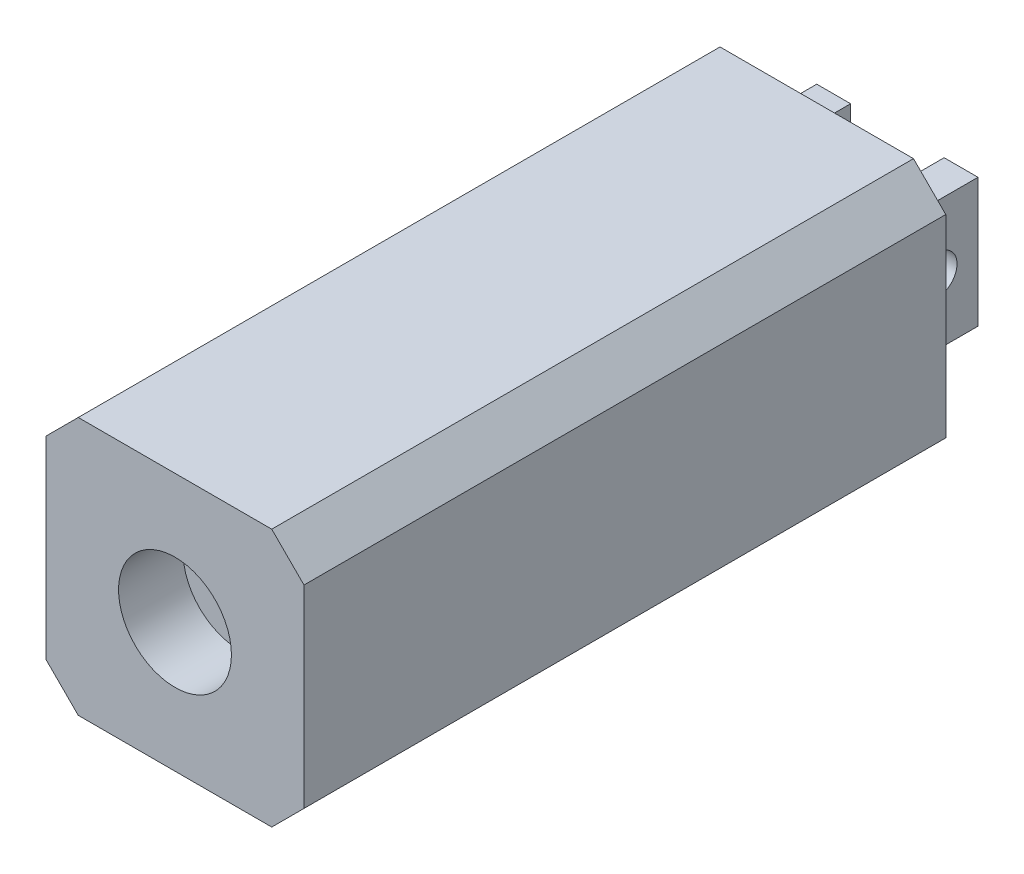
ISO-10303-21;
HEADER;
FILE_DESCRIPTION(('STEP AP214'),'2;1');
FILE_NAME('part.step','',(''),(''),'','','');
FILE_SCHEMA(('AUTOMOTIVE_DESIGN { 1 0 10303 214 1 1 1 1 }'));
ENDSEC;
DATA;
#1=APPLICATION_CONTEXT('core data for automotive mechanical design processes');
#2=APPLICATION_PROTOCOL_DEFINITION('international standard','automotive_design',2000,#1);
#3=PRODUCT_CONTEXT('',#1,'mechanical');
#4=PRODUCT('Part','Part','',(#3));
#5=PRODUCT_RELATED_PRODUCT_CATEGORY('part','',(#4));
#6=PRODUCT_DEFINITION_FORMATION('','',#4);
#7=PRODUCT_DEFINITION_CONTEXT('part definition',#1,'design');
#8=PRODUCT_DEFINITION('design','',#6,#7);
#9=PRODUCT_DEFINITION_SHAPE('','',#8);
#10=(LENGTH_UNIT() NAMED_UNIT(*) SI_UNIT(.MILLI.,.METRE.));
#11=(NAMED_UNIT(*) PLANE_ANGLE_UNIT() SI_UNIT($,.RADIAN.));
#12=(NAMED_UNIT(*) SI_UNIT($,.STERADIAN.) SOLID_ANGLE_UNIT());
#13=UNCERTAINTY_MEASURE_WITH_UNIT(LENGTH_MEASURE(1.E-05),#10,'distance_accuracy_value','');
#14=(GEOMETRIC_REPRESENTATION_CONTEXT(3) GLOBAL_UNCERTAINTY_ASSIGNED_CONTEXT((#13)) GLOBAL_UNIT_ASSIGNED_CONTEXT((#10,
#11,#12)) REPRESENTATION_CONTEXT('',''));
#15=CARTESIAN_POINT('',(0.,0.,0.));
#16=DIRECTION('',(0.,0.,1.));
#17=DIRECTION('',(1.,0.,0.));
#18=AXIS2_PLACEMENT_3D('',#15,#16,#17);
#19=CARTESIAN_POINT('',(65.,20.,-25.));
#20=DIRECTION('',(0.,1.,0.));
#21=DIRECTION('',(0.,0.,1.));
#22=AXIS2_PLACEMENT_3D('',#19,#20,#21);
#23=PLANE('',#22);
#24=DIRECTION('',(-1.,0.,0.));
#25=VECTOR('',#24,1.);
#26=CARTESIAN_POINT('',(65.,20.,0.));
#27=LINE('',#26,#25);
#28=CARTESIAN_POINT('',(65.,20.,0.));
#29=VERTEX_POINT('',#28);
#30=CARTESIAN_POINT('',(54.5,20.,0.));
#31=VERTEX_POINT('',#30);
#32=EDGE_CURVE('E169',#29,#31,#27,.T.);
#33=ORIENTED_EDGE('',*,*,#32,.T.);
#34=DIRECTION('',(0.,0.,-1.));
#35=VECTOR('',#34,1.);
#36=CARTESIAN_POINT('',(54.5,20.,0.));
#37=LINE('',#36,#35);
#38=CARTESIAN_POINT('',(54.5,20.,-25.));
#39=VERTEX_POINT('',#38);
#40=EDGE_CURVE('E154',#31,#39,#37,.T.);
#41=ORIENTED_EDGE('',*,*,#40,.T.);
#42=DIRECTION('',(-1.,0.,0.));
#43=VECTOR('',#42,1.);
#44=CARTESIAN_POINT('',(65.,20.,-25.));
#45=LINE('',#44,#43);
#46=CARTESIAN_POINT('',(65.,20.,-25.));
#47=VERTEX_POINT('',#46);
#48=EDGE_CURVE('E166',#47,#39,#45,.T.);
#49=ORIENTED_EDGE('',*,*,#48,.F.);
#50=DIRECTION('',(0.,0.,1.));
#51=VECTOR('',#50,1.);
#52=CARTESIAN_POINT('',(65.,20.,-25.));
#53=LINE('',#52,#51);
#54=EDGE_CURVE('E194',#47,#29,#53,.T.);
#55=ORIENTED_EDGE('',*,*,#54,.T.);
#56=EDGE_LOOP('',(#33,#41,#49,#55));
#57=FACE_BOUND('',#56,.T.);
#58=ADVANCED_FACE('F37',(#57),#23,.F.);
#59=CARTESIAN_POINT('',(65.,60.,-25.));
#60=DIRECTION('',(0.,-1.,0.));
#61=DIRECTION('',(0.,0.,-1.));
#62=AXIS2_PLACEMENT_3D('',#59,#60,#61);
#63=PLANE('',#62);
#64=DIRECTION('',(1.,0.,0.));
#65=VECTOR('',#64,1.);
#66=CARTESIAN_POINT('',(65.,60.,-25.));
#67=LINE('',#66,#65);
#68=CARTESIAN_POINT('',(54.5,60.,-25.));
#69=VERTEX_POINT('',#68);
#70=CARTESIAN_POINT('',(65.,60.,-25.));
#71=VERTEX_POINT('',#70);
#72=EDGE_CURVE('E179',#69,#71,#67,.T.);
#73=ORIENTED_EDGE('',*,*,#72,.F.);
#74=DIRECTION('',(0.,0.,-1.));
#75=VECTOR('',#74,1.);
#76=CARTESIAN_POINT('',(54.5,60.,0.));
#77=LINE('',#76,#75);
#78=CARTESIAN_POINT('',(54.5,60.,0.));
#79=VERTEX_POINT('',#78);
#80=EDGE_CURVE('E157',#79,#69,#77,.T.);
#81=ORIENTED_EDGE('',*,*,#80,.F.);
#82=DIRECTION('',(1.,0.,0.));
#83=VECTOR('',#82,1.);
#84=CARTESIAN_POINT('',(65.,60.,0.));
#85=LINE('',#84,#83);
#86=CARTESIAN_POINT('',(65.,60.,0.));
#87=VERTEX_POINT('',#86);
#88=EDGE_CURVE('E355',#79,#87,#85,.T.);
#89=ORIENTED_EDGE('',*,*,#88,.T.);
#90=DIRECTION('',(0.,0.,1.));
#91=VECTOR('',#90,1.);
#92=CARTESIAN_POINT('',(65.,60.,-25.));
#93=LINE('',#92,#91);
#94=EDGE_CURVE('E187',#71,#87,#93,.T.);
#95=ORIENTED_EDGE('',*,*,#94,.F.);
#96=EDGE_LOOP('',(#73,#81,#89,#95));
#97=FACE_BOUND('',#96,.T.);
#98=ADVANCED_FACE('F310',(#97),#63,.F.);
#99=CARTESIAN_POINT('',(65.,60.,-25.));
#100=DIRECTION('',(0.,0.,1.));
#101=DIRECTION('',(1.,0.,0.));
#102=AXIS2_PLACEMENT_3D('',#99,#100,#101);
#103=PLANE('',#102);
#104=ORIENTED_EDGE('',*,*,#48,.T.);
#105=DIRECTION('',(0.,-1.,0.));
#106=VECTOR('',#105,1.);
#107=CARTESIAN_POINT('',(54.5,20.,-25.));
#108=LINE('',#107,#106);
#109=EDGE_CURVE('E151',#69,#39,#108,.T.);
#110=ORIENTED_EDGE('',*,*,#109,.F.);
#111=ORIENTED_EDGE('',*,*,#72,.T.);
#112=DIRECTION('',(0.,-1.,0.));
#113=VECTOR('',#112,1.);
#114=CARTESIAN_POINT('',(65.,20.,-25.));
#115=LINE('',#114,#113);
#116=EDGE_CURVE('E174',#71,#47,#115,.T.);
#117=ORIENTED_EDGE('',*,*,#116,.T.);
#118=EDGE_LOOP('',(#104,#110,#111,#117));
#119=FACE_BOUND('',#118,.T.);
#120=ADVANCED_FACE('F172',(#119),#103,.F.);
#121=CARTESIAN_POINT('',(0.,80.,0.));
#122=DIRECTION('',(0.,0.,-1.));
#123=DIRECTION('',(-1.,0.,0.));
#124=AXIS2_PLACEMENT_3D('',#121,#122,#123);
#125=PLANE('',#124);
#126=CARTESIAN_POINT('',(25.5,20.,0.));
#127=VERTEX_POINT('',#126);
#128=CARTESIAN_POINT('',(15.,20.,0.));
#129=VERTEX_POINT('',#128);
#130=EDGE_CURVE('E352',#127,#129,#27,.T.);
#131=ORIENTED_EDGE('',*,*,#130,.F.);
#132=DIRECTION('',(0.,1.,0.));
#133=VECTOR('',#132,1.);
#134=CARTESIAN_POINT('',(25.5,20.,0.));
#135=LINE('',#134,#133);
#136=CARTESIAN_POINT('',(25.5,60.,0.));
#137=VERTEX_POINT('',#136);
#138=EDGE_CURVE('E170',#127,#137,#135,.T.);
#139=ORIENTED_EDGE('',*,*,#138,.T.);
#140=CARTESIAN_POINT('',(15.,60.,0.));
#141=VERTEX_POINT('',#140);
#142=EDGE_CURVE('E356',#141,#137,#85,.T.);
#143=ORIENTED_EDGE('',*,*,#142,.F.);
#144=DIRECTION('',(0.,1.,0.));
#145=VECTOR('',#144,1.);
#146=CARTESIAN_POINT('',(15.,20.,0.));
#147=LINE('',#146,#145);
#148=EDGE_CURVE('E354',#129,#141,#147,.T.);
#149=ORIENTED_EDGE('',*,*,#148,.F.);
#150=EDGE_LOOP('',(#131,#139,#143,#149));
#151=FACE_BOUND('',#150,.T.);
#152=DIRECTION('',(-1.,0.,0.));
#153=VECTOR('',#152,1.);
#154=CARTESIAN_POINT('',(0.,80.,0.));
#155=LINE('',#154,#153);
#156=CARTESIAN_POINT('',(69.9999999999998,80.,0.));
#157=VERTEX_POINT('',#156);
#158=CARTESIAN_POINT('',(10.0000000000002,80.,0.));
#159=VERTEX_POINT('',#158);
#160=EDGE_CURVE('E211',#157,#159,#155,.T.);
#161=ORIENTED_EDGE('',*,*,#160,.F.);
#162=DIRECTION('',(-0.707106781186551,0.707106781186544,0.));
#163=VECTOR('',#162,1.);
#164=CARTESIAN_POINT('',(34.9999999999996,115.,0.));
#165=LINE('',#164,#163);
#166=CARTESIAN_POINT('',(80.,69.9999999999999,0.));
#167=VERTEX_POINT('',#166);
#168=EDGE_CURVE('E237',#157,#167,#165,.F.);
#169=ORIENTED_EDGE('',*,*,#168,.T.);
#170=DIRECTION('',(0.,1.,0.));
#171=VECTOR('',#170,1.);
#172=CARTESIAN_POINT('',(80.,0.,0.));
#173=LINE('',#172,#171);
#174=CARTESIAN_POINT('',(80.,10.0000000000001,0.));
#175=VERTEX_POINT('',#174);
#176=EDGE_CURVE('E208',#175,#167,#173,.T.);
#177=ORIENTED_EDGE('',*,*,#176,.F.);
#178=DIRECTION('',(0.707106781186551,0.707106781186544,0.));
#179=VECTOR('',#178,1.);
#180=CARTESIAN_POINT('',(74.9999999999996,4.99999999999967,0.));
#181=LINE('',#180,#179);
#182=CARTESIAN_POINT('',(69.9999999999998,0.,0.));
#183=VERTEX_POINT('',#182);
#184=EDGE_CURVE('E233',#175,#183,#181,.F.);
#185=ORIENTED_EDGE('',*,*,#184,.T.);
#186=DIRECTION('',(1.,0.,0.));
#187=VECTOR('',#186,1.);
#188=CARTESIAN_POINT('',(0.,0.,0.));
#189=LINE('',#188,#187);
#190=CARTESIAN_POINT('',(10.0000000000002,0.,0.));
#191=VERTEX_POINT('',#190);
#192=EDGE_CURVE('E205',#191,#183,#189,.T.);
#193=ORIENTED_EDGE('',*,*,#192,.F.);
#194=DIRECTION('',(0.707106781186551,-0.707106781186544,0.));
#195=VECTOR('',#194,1.);
#196=CARTESIAN_POINT('',(-35.,44.9999999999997,0.));
#197=LINE('',#196,#195);
#198=CARTESIAN_POINT('',(0.,10.0000000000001,0.));
#199=VERTEX_POINT('',#198);
#200=EDGE_CURVE('E231',#191,#199,#197,.F.);
#201=ORIENTED_EDGE('',*,*,#200,.T.);
#202=DIRECTION('',(0.,-1.,0.));
#203=VECTOR('',#202,1.);
#204=CARTESIAN_POINT('',(0.,0.,0.));
#205=LINE('',#204,#203);
#206=CARTESIAN_POINT('',(0.,69.9999999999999,0.));
#207=VERTEX_POINT('',#206);
#208=EDGE_CURVE('E202',#207,#199,#205,.T.);
#209=ORIENTED_EDGE('',*,*,#208,.F.);
#210=DIRECTION('',(-0.707106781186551,-0.707106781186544,0.));
#211=VECTOR('',#210,1.);
#212=CARTESIAN_POINT('',(5.00000000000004,74.9999999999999,0.));
#213=LINE('',#212,#211);
#214=EDGE_CURVE('E235',#207,#159,#213,.F.);
#215=ORIENTED_EDGE('',*,*,#214,.T.);
#216=EDGE_LOOP('',(#161,#169,#177,#185,#193,#201,#209,#215));
#217=FACE_BOUND('',#216,.T.);
#218=ORIENTED_EDGE('',*,*,#32,.F.);
#219=DIRECTION('',(0.,-1.,0.));
#220=VECTOR('',#219,1.);
#221=CARTESIAN_POINT('',(65.,20.,0.));
#222=LINE('',#221,#220);
#223=EDGE_CURVE('E346',#87,#29,#222,.T.);
#224=ORIENTED_EDGE('',*,*,#223,.F.);
#225=ORIENTED_EDGE('',*,*,#88,.F.);
#226=DIRECTION('',(0.,-1.,0.));
#227=VECTOR('',#226,1.);
#228=CARTESIAN_POINT('',(54.5,20.,0.));
#229=LINE('',#228,#227);
#230=EDGE_CURVE('E338',#79,#31,#229,.T.);
#231=ORIENTED_EDGE('',*,*,#230,.T.);
#232=EDGE_LOOP('',(#218,#224,#225,#231));
#233=FACE_BOUND('',#232,.T.);
#234=ADVANCED_FACE('F268',(#151,#217,#233),#125,.T.);
#235=CARTESIAN_POINT('',(0.,0.,199.));
#236=DIRECTION('',(1.,0.,0.));
#237=DIRECTION('',(0.,0.,-1.));
#238=AXIS2_PLACEMENT_3D('',#235,#236,#237);
#239=PLANE('',#238);
#240=DIRECTION('',(0.,-1.,0.));
#241=VECTOR('',#240,1.);
#242=CARTESIAN_POINT('',(0.,0.,199.));
#243=LINE('',#242,#241);
#244=CARTESIAN_POINT('',(0.,69.9999999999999,199.));
#245=VERTEX_POINT('',#244);
#246=CARTESIAN_POINT('',(0.,10.0000000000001,199.));
#247=VERTEX_POINT('',#246);
#248=EDGE_CURVE('E214',#245,#247,#243,.T.);
#249=ORIENTED_EDGE('',*,*,#248,.F.);
#250=DIRECTION('',(0.,0.,-1.));
#251=VECTOR('',#250,1.);
#252=CARTESIAN_POINT('',(0.,69.9999999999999,199.));
#253=LINE('',#252,#251);
#254=EDGE_CURVE('E254',#245,#207,#253,.T.);
#255=ORIENTED_EDGE('',*,*,#254,.T.);
#256=ORIENTED_EDGE('',*,*,#208,.T.);
#257=DIRECTION('',(0.,0.,1.));
#258=VECTOR('',#257,1.);
#259=CARTESIAN_POINT('',(0.,10.0000000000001,199.));
#260=LINE('',#259,#258);
#261=EDGE_CURVE('E252',#199,#247,#260,.T.);
#262=ORIENTED_EDGE('',*,*,#261,.T.);
#263=EDGE_LOOP('',(#249,#255,#256,#262));
#264=FACE_BOUND('',#263,.T.);
#265=ADVANCED_FACE('F39',(#264),#239,.F.);
#266=CARTESIAN_POINT('',(0.,0.,199.));
#267=DIRECTION('',(0.,1.,0.));
#268=DIRECTION('',(0.,0.,1.));
#269=AXIS2_PLACEMENT_3D('',#266,#267,#268);
#270=PLANE('',#269);
#271=ORIENTED_EDGE('',*,*,#192,.T.);
#272=DIRECTION('',(0.,0.,1.));
#273=VECTOR('',#272,1.);
#274=CARTESIAN_POINT('',(69.9999999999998,0.,199.));
#275=LINE('',#274,#273);
#276=CARTESIAN_POINT('',(69.9999999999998,0.,199.));
#277=VERTEX_POINT('',#276);
#278=EDGE_CURVE('E11',#183,#277,#275,.T.);
#279=ORIENTED_EDGE('',*,*,#278,.T.);
#280=DIRECTION('',(1.,0.,0.));
#281=VECTOR('',#280,1.);
#282=CARTESIAN_POINT('',(0.,0.,199.));
#283=LINE('',#282,#281);
#284=CARTESIAN_POINT('',(10.0000000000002,0.,199.));
#285=VERTEX_POINT('',#284);
#286=EDGE_CURVE('E217',#285,#277,#283,.T.);
#287=ORIENTED_EDGE('',*,*,#286,.F.);
#288=DIRECTION('',(0.,0.,-1.));
#289=VECTOR('',#288,1.);
#290=CARTESIAN_POINT('',(10.0000000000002,0.,199.));
#291=LINE('',#290,#289);
#292=EDGE_CURVE('E46',#285,#191,#291,.T.);
#293=ORIENTED_EDGE('',*,*,#292,.T.);
#294=EDGE_LOOP('',(#271,#279,#287,#293));
#295=FACE_BOUND('',#294,.T.);
#296=ADVANCED_FACE('F262',(#295),#270,.F.);
#297=CARTESIAN_POINT('',(80.,0.,199.));
#298=DIRECTION('',(-1.,0.,0.));
#299=DIRECTION('',(0.,0.,1.));
#300=AXIS2_PLACEMENT_3D('',#297,#298,#299);
#301=PLANE('',#300);
#302=ORIENTED_EDGE('',*,*,#176,.T.);
#303=DIRECTION('',(0.,0.,1.));
#304=VECTOR('',#303,1.);
#305=CARTESIAN_POINT('',(80.,69.9999999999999,199.));
#306=LINE('',#305,#304);
#307=CARTESIAN_POINT('',(80.,69.9999999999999,199.));
#308=VERTEX_POINT('',#307);
#309=EDGE_CURVE('E242',#167,#308,#306,.T.);
#310=ORIENTED_EDGE('',*,*,#309,.T.);
#311=DIRECTION('',(0.,1.,0.));
#312=VECTOR('',#311,1.);
#313=CARTESIAN_POINT('',(80.,0.,199.));
#314=LINE('',#313,#312);
#315=CARTESIAN_POINT('',(80.,10.0000000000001,199.));
#316=VERTEX_POINT('',#315);
#317=EDGE_CURVE('E220',#316,#308,#314,.T.);
#318=ORIENTED_EDGE('',*,*,#317,.F.);
#319=DIRECTION('',(0.,0.,-1.));
#320=VECTOR('',#319,1.);
#321=CARTESIAN_POINT('',(80.,10.0000000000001,199.));
#322=LINE('',#321,#320);
#323=EDGE_CURVE('E239',#316,#175,#322,.T.);
#324=ORIENTED_EDGE('',*,*,#323,.T.);
#325=EDGE_LOOP('',(#302,#310,#318,#324));
#326=FACE_BOUND('',#325,.T.);
#327=ADVANCED_FACE('F278',(#326),#301,.F.);
#328=CARTESIAN_POINT('',(0.,80.,199.));
#329=DIRECTION('',(0.,-1.,0.));
#330=DIRECTION('',(0.,0.,-1.));
#331=AXIS2_PLACEMENT_3D('',#328,#329,#330);
#332=PLANE('',#331);
#333=DIRECTION('',(-1.,0.,0.));
#334=VECTOR('',#333,1.);
#335=CARTESIAN_POINT('',(0.,80.,199.));
#336=LINE('',#335,#334);
#337=CARTESIAN_POINT('',(69.9999999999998,80.,199.));
#338=VERTEX_POINT('',#337);
#339=CARTESIAN_POINT('',(10.0000000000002,80.,199.));
#340=VERTEX_POINT('',#339);
#341=EDGE_CURVE('E223',#338,#340,#336,.T.);
#342=ORIENTED_EDGE('',*,*,#341,.F.);
#343=DIRECTION('',(0.,0.,-1.));
#344=VECTOR('',#343,1.);
#345=CARTESIAN_POINT('',(69.9999999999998,80.,199.));
#346=LINE('',#345,#344);
#347=EDGE_CURVE('E228',#338,#157,#346,.T.);
#348=ORIENTED_EDGE('',*,*,#347,.T.);
#349=ORIENTED_EDGE('',*,*,#160,.T.);
#350=DIRECTION('',(0.,0.,1.));
#351=VECTOR('',#350,1.);
#352=CARTESIAN_POINT('',(10.0000000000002,80.,199.));
#353=LINE('',#352,#351);
#354=EDGE_CURVE('E226',#159,#340,#353,.T.);
#355=ORIENTED_EDGE('',*,*,#354,.T.);
#356=EDGE_LOOP('',(#342,#348,#349,#355));
#357=FACE_BOUND('',#356,.T.);
#358=ADVANCED_FACE('F288',(#357),#332,.F.);
#359=CARTESIAN_POINT('',(0.,80.,199.));
#360=DIRECTION('',(0.,0.,-1.));
#361=DIRECTION('',(-1.,0.,0.));
#362=AXIS2_PLACEMENT_3D('',#359,#360,#361);
#363=PLANE('',#362);
#364=CARTESIAN_POINT('',(40.,40.,199.));
#365=DIRECTION('',(0.,0.,1.));
#366=DIRECTION('',(1.,0.,0.));
#367=AXIS2_PLACEMENT_3D('',#364,#365,#366);
#368=CIRCLE('',#367,17.5);
#369=CARTESIAN_POINT('',(57.5,40.,199.));
#370=VERTEX_POINT('',#369);
#371=EDGE_CURVE('E196',#370,#370,#368,.T.);
#372=ORIENTED_EDGE('',*,*,#371,.F.);
#373=EDGE_LOOP('',(#372));
#374=FACE_BOUND('',#373,.T.);
#375=ORIENTED_EDGE('',*,*,#317,.T.);
#376=DIRECTION('',(0.707106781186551,-0.707106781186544,0.));
#377=VECTOR('',#376,1.);
#378=CARTESIAN_POINT('',(69.9999999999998,80.,199.));
#379=LINE('',#378,#377);
#380=EDGE_CURVE('E250',#308,#338,#379,.F.);
#381=ORIENTED_EDGE('',*,*,#380,.T.);
#382=ORIENTED_EDGE('',*,*,#341,.T.);
#383=DIRECTION('',(0.707106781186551,0.707106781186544,0.));
#384=VECTOR('',#383,1.);
#385=CARTESIAN_POINT('',(0.,69.9999999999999,199.));
#386=LINE('',#385,#384);
#387=EDGE_CURVE('E248',#340,#245,#386,.F.);
#388=ORIENTED_EDGE('',*,*,#387,.T.);
#389=ORIENTED_EDGE('',*,*,#248,.T.);
#390=DIRECTION('',(-0.707106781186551,0.707106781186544,0.));
#391=VECTOR('',#390,1.);
#392=CARTESIAN_POINT('',(10.0000000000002,0.,199.));
#393=LINE('',#392,#391);
#394=EDGE_CURVE('E244',#247,#285,#393,.F.);
#395=ORIENTED_EDGE('',*,*,#394,.T.);
#396=ORIENTED_EDGE('',*,*,#286,.T.);
#397=DIRECTION('',(-0.707106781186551,-0.707106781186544,0.));
#398=VECTOR('',#397,1.);
#399=CARTESIAN_POINT('',(80.,10.0000000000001,199.));
#400=LINE('',#399,#398);
#401=EDGE_CURVE('E246',#277,#316,#400,.F.);
#402=ORIENTED_EDGE('',*,*,#401,.T.);
#403=EDGE_LOOP('',(#375,#381,#382,#388,#389,#395,#396,#402));
#404=FACE_BOUND('',#403,.T.);
#405=ADVANCED_FACE('F282',(#374,#404),#363,.F.);
#406=CARTESIAN_POINT('',(69.9999999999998,80.,199.));
#407=DIRECTION('',(-0.707106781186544,-0.707106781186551,0.));
#408=DIRECTION('',(0.707106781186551,-0.707106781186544,0.));
#409=AXIS2_PLACEMENT_3D('',#406,#407,#408);
#410=PLANE('',#409);
#411=ORIENTED_EDGE('',*,*,#380,.F.);
#412=ORIENTED_EDGE('',*,*,#309,.F.);
#413=ORIENTED_EDGE('',*,*,#168,.F.);
#414=ORIENTED_EDGE('',*,*,#347,.F.);
#415=EDGE_LOOP('',(#411,#412,#413,#414));
#416=FACE_BOUND('',#415,.T.);
#417=ADVANCED_FACE('F286',(#416),#410,.F.);
#418=CARTESIAN_POINT('',(0.,69.9999999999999,199.));
#419=DIRECTION('',(0.707106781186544,-0.707106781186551,0.));
#420=DIRECTION('',(0.707106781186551,0.707106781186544,0.));
#421=AXIS2_PLACEMENT_3D('',#418,#419,#420);
#422=PLANE('',#421);
#423=ORIENTED_EDGE('',*,*,#387,.F.);
#424=ORIENTED_EDGE('',*,*,#354,.F.);
#425=ORIENTED_EDGE('',*,*,#214,.F.);
#426=ORIENTED_EDGE('',*,*,#254,.F.);
#427=EDGE_LOOP('',(#423,#424,#425,#426));
#428=FACE_BOUND('',#427,.T.);
#429=ADVANCED_FACE('F293',(#428),#422,.F.);
#430=CARTESIAN_POINT('',(80.,10.0000000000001,199.));
#431=DIRECTION('',(-0.707106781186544,0.707106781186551,0.));
#432=DIRECTION('',(-0.707106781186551,-0.707106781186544,0.));
#433=AXIS2_PLACEMENT_3D('',#430,#431,#432);
#434=PLANE('',#433);
#435=ORIENTED_EDGE('',*,*,#401,.F.);
#436=ORIENTED_EDGE('',*,*,#278,.F.);
#437=ORIENTED_EDGE('',*,*,#184,.F.);
#438=ORIENTED_EDGE('',*,*,#323,.F.);
#439=EDGE_LOOP('',(#435,#436,#437,#438));
#440=FACE_BOUND('',#439,.T.);
#441=ADVANCED_FACE('F275',(#440),#434,.F.);
#442=CARTESIAN_POINT('',(10.0000000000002,0.,199.));
#443=DIRECTION('',(0.707106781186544,0.707106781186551,0.));
#444=DIRECTION('',(-0.707106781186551,0.707106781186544,0.));
#445=AXIS2_PLACEMENT_3D('',#442,#443,#444);
#446=PLANE('',#445);
#447=ORIENTED_EDGE('',*,*,#394,.F.);
#448=ORIENTED_EDGE('',*,*,#261,.F.);
#449=ORIENTED_EDGE('',*,*,#200,.F.);
#450=ORIENTED_EDGE('',*,*,#292,.F.);
#451=EDGE_LOOP('',(#447,#448,#449,#450));
#452=FACE_BOUND('',#451,.T.);
#453=ADVANCED_FACE('F297',(#452),#446,.F.);
#454=CARTESIAN_POINT('',(40.,40.,179.));
#455=DIRECTION('',(0.,0.,1.));
#456=DIRECTION('',(1.,0.,0.));
#457=AXIS2_PLACEMENT_3D('',#454,#455,#456);
#458=CYLINDRICAL_SURFACE('',#457,17.5);
#459=CARTESIAN_POINT('',(40.,40.,179.));
#460=DIRECTION('',(0.,0.,1.));
#461=DIRECTION('',(1.,0.,0.));
#462=AXIS2_PLACEMENT_3D('',#459,#460,#461);
#463=CIRCLE('',#462,17.5);
#464=CARTESIAN_POINT('',(57.5,40.,179.));
#465=VERTEX_POINT('',#464);
#466=EDGE_CURVE('E199',#465,#465,#463,.T.);
#467=ORIENTED_EDGE('',*,*,#466,.F.);
#468=EDGE_LOOP('',(#467));
#469=FACE_BOUND('',#468,.T.);
#470=ORIENTED_EDGE('',*,*,#371,.T.);
#471=EDGE_LOOP('',(#470));
#472=FACE_BOUND('',#471,.T.);
#473=ADVANCED_FACE('F299',(#469,#472),#458,.F.);
#474=CARTESIAN_POINT('',(40.,40.,179.));
#475=DIRECTION('',(0.,0.,1.));
#476=DIRECTION('',(1.,0.,0.));
#477=AXIS2_PLACEMENT_3D('',#474,#475,#476);
#478=PLANE('',#477);
#479=ORIENTED_EDGE('',*,*,#466,.T.);
#480=EDGE_LOOP('',(#479));
#481=FACE_BOUND('',#480,.T.);
#482=ADVANCED_FACE('F305',(#481),#478,.T.);
#483=CARTESIAN_POINT('',(65.,20.,-25.));
#484=DIRECTION('',(-1.,0.,0.));
#485=DIRECTION('',(0.,0.,1.));
#486=AXIS2_PLACEMENT_3D('',#483,#484,#485);
#487=PLANE('',#486);
#488=CARTESIAN_POINT('',(65.,40.,-12.5));
#489=DIRECTION('',(-1.,0.,0.));
#490=DIRECTION('',(0.,0.,1.));
#491=AXIS2_PLACEMENT_3D('',#488,#489,#490);
#492=CIRCLE('',#491,6.);
#493=CARTESIAN_POINT('',(65.,40.,-6.5));
#494=VERTEX_POINT('',#493);
#495=EDGE_CURVE('E162',#494,#494,#492,.T.);
#496=ORIENTED_EDGE('',*,*,#495,.T.);
#497=EDGE_LOOP('',(#496));
#498=FACE_BOUND('',#497,.T.);
#499=ORIENTED_EDGE('',*,*,#223,.T.);
#500=ORIENTED_EDGE('',*,*,#54,.F.);
#501=ORIENTED_EDGE('',*,*,#116,.F.);
#502=ORIENTED_EDGE('',*,*,#94,.T.);
#503=EDGE_LOOP('',(#499,#500,#501,#502));
#504=FACE_BOUND('',#503,.T.);
#505=ADVANCED_FACE('F323',(#498,#504),#487,.F.);
#506=CARTESIAN_POINT('',(25.5,20.,-25.));
#507=VERTEX_POINT('',#506);
#508=CARTESIAN_POINT('',(15.,20.,-25.));
#509=VERTEX_POINT('',#508);
#510=EDGE_CURVE('E177',#507,#509,#45,.T.);
#511=ORIENTED_EDGE('',*,*,#510,.F.);
#512=DIRECTION('',(0.,0.,-1.));
#513=VECTOR('',#512,1.);
#514=CARTESIAN_POINT('',(25.5,20.,0.));
#515=LINE('',#514,#513);
#516=EDGE_CURVE('E53',#127,#507,#515,.T.);
#517=ORIENTED_EDGE('',*,*,#516,.F.);
#518=ORIENTED_EDGE('',*,*,#130,.T.);
#519=DIRECTION('',(0.,0.,1.));
#520=VECTOR('',#519,1.);
#521=CARTESIAN_POINT('',(15.,20.,-25.));
#522=LINE('',#521,#520);
#523=EDGE_CURVE('E191',#509,#129,#522,.T.);
#524=ORIENTED_EDGE('',*,*,#523,.F.);
#525=EDGE_LOOP('',(#511,#517,#518,#524));
#526=FACE_BOUND('',#525,.T.);
#527=ADVANCED_FACE('F312',(#526),#23,.F.);
#528=CARTESIAN_POINT('',(15.,20.,-25.));
#529=DIRECTION('',(1.,0.,0.));
#530=DIRECTION('',(0.,0.,-1.));
#531=AXIS2_PLACEMENT_3D('',#528,#529,#530);
#532=PLANE('',#531);
#533=CARTESIAN_POINT('',(15.,40.,-12.5));
#534=DIRECTION('',(-1.,0.,0.));
#535=DIRECTION('',(0.,0.,1.));
#536=AXIS2_PLACEMENT_3D('',#533,#534,#535);
#537=CIRCLE('',#536,6.);
#538=CARTESIAN_POINT('',(15.,40.,-6.5));
#539=VERTEX_POINT('',#538);
#540=EDGE_CURVE('E514',#539,#539,#537,.T.);
#541=ORIENTED_EDGE('',*,*,#540,.F.);
#542=EDGE_LOOP('',(#541));
#543=FACE_BOUND('',#542,.T.);
#544=ORIENTED_EDGE('',*,*,#148,.T.);
#545=DIRECTION('',(0.,0.,1.));
#546=VECTOR('',#545,1.);
#547=CARTESIAN_POINT('',(15.,60.,-25.));
#548=LINE('',#547,#546);
#549=CARTESIAN_POINT('',(15.,60.,-25.));
#550=VERTEX_POINT('',#549);
#551=EDGE_CURVE('E61',#550,#141,#548,.T.);
#552=ORIENTED_EDGE('',*,*,#551,.F.);
#553=DIRECTION('',(0.,1.,0.));
#554=VECTOR('',#553,1.);
#555=CARTESIAN_POINT('',(15.,20.,-25.));
#556=LINE('',#555,#554);
#557=EDGE_CURVE('E176',#509,#550,#556,.T.);
#558=ORIENTED_EDGE('',*,*,#557,.F.);
#559=ORIENTED_EDGE('',*,*,#523,.T.);
#560=EDGE_LOOP('',(#544,#552,#558,#559));
#561=FACE_BOUND('',#560,.T.);
#562=ADVANCED_FACE('F322',(#543,#561),#532,.F.);
#563=ORIENTED_EDGE('',*,*,#142,.T.);
#564=DIRECTION('',(0.,0.,-1.));
#565=VECTOR('',#564,1.);
#566=CARTESIAN_POINT('',(25.5,60.,0.));
#567=LINE('',#566,#565);
#568=CARTESIAN_POINT('',(25.5,60.,-25.));
#569=VERTEX_POINT('',#568);
#570=EDGE_CURVE('E347',#137,#569,#567,.T.);
#571=ORIENTED_EDGE('',*,*,#570,.T.);
#572=EDGE_CURVE('E184',#550,#569,#67,.T.);
#573=ORIENTED_EDGE('',*,*,#572,.F.);
#574=ORIENTED_EDGE('',*,*,#551,.T.);
#575=EDGE_LOOP('',(#563,#571,#573,#574));
#576=FACE_BOUND('',#575,.T.);
#577=ADVANCED_FACE('F318',(#576),#63,.F.);
#578=ORIENTED_EDGE('',*,*,#572,.T.);
#579=DIRECTION('',(0.,1.,0.));
#580=VECTOR('',#579,1.);
#581=CARTESIAN_POINT('',(25.5,20.,-25.));
#582=LINE('',#581,#580);
#583=EDGE_CURVE('E161',#507,#569,#582,.T.);
#584=ORIENTED_EDGE('',*,*,#583,.F.);
#585=ORIENTED_EDGE('',*,*,#510,.T.);
#586=ORIENTED_EDGE('',*,*,#557,.T.);
#587=EDGE_LOOP('',(#578,#584,#585,#586));
#588=FACE_BOUND('',#587,.T.);
#589=ADVANCED_FACE('F336',(#588),#103,.F.);
#590=CARTESIAN_POINT('',(54.5,20.,0.));
#591=DIRECTION('',(1.,0.,0.));
#592=DIRECTION('',(0.,0.,-1.));
#593=AXIS2_PLACEMENT_3D('',#590,#591,#592);
#594=PLANE('',#593);
#595=CARTESIAN_POINT('',(54.5,40.,-12.5));
#596=DIRECTION('',(1.,0.,0.));
#597=DIRECTION('',(0.,0.,-1.));
#598=AXIS2_PLACEMENT_3D('',#595,#596,#597);
#599=CIRCLE('',#598,6.);
#600=CARTESIAN_POINT('',(54.5,40.,-18.5));
#601=VERTEX_POINT('',#600);
#602=EDGE_CURVE('E509',#601,#601,#599,.T.);
#603=ORIENTED_EDGE('',*,*,#602,.T.);
#604=EDGE_LOOP('',(#603));
#605=FACE_BOUND('',#604,.T.);
#606=ORIENTED_EDGE('',*,*,#109,.T.);
#607=ORIENTED_EDGE('',*,*,#40,.F.);
#608=ORIENTED_EDGE('',*,*,#230,.F.);
#609=ORIENTED_EDGE('',*,*,#80,.T.);
#610=EDGE_LOOP('',(#606,#607,#608,#609));
#611=FACE_BOUND('',#610,.T.);
#612=ADVANCED_FACE('F153',(#605,#611),#594,.F.);
#613=CARTESIAN_POINT('',(25.5,20.,0.));
#614=DIRECTION('',(-1.,0.,0.));
#615=DIRECTION('',(0.,0.,1.));
#616=AXIS2_PLACEMENT_3D('',#613,#614,#615);
#617=PLANE('',#616);
#618=CARTESIAN_POINT('',(25.5,40.,-12.5));
#619=DIRECTION('',(-1.,0.,0.));
#620=DIRECTION('',(0.,0.,1.));
#621=AXIS2_PLACEMENT_3D('',#618,#619,#620);
#622=CIRCLE('',#621,6.);
#623=CARTESIAN_POINT('',(25.5,40.,-6.5));
#624=VERTEX_POINT('',#623);
#625=EDGE_CURVE('E41',#624,#624,#622,.T.);
#626=ORIENTED_EDGE('',*,*,#625,.T.);
#627=EDGE_LOOP('',(#626));
#628=FACE_BOUND('',#627,.T.);
#629=ORIENTED_EDGE('',*,*,#583,.T.);
#630=ORIENTED_EDGE('',*,*,#570,.F.);
#631=ORIENTED_EDGE('',*,*,#138,.F.);
#632=ORIENTED_EDGE('',*,*,#516,.T.);
#633=EDGE_LOOP('',(#629,#630,#631,#632));
#634=FACE_BOUND('',#633,.T.);
#635=ADVANCED_FACE('F471',(#628,#634),#617,.F.);
#636=CARTESIAN_POINT('',(80.,40.,-12.5));
#637=DIRECTION('',(-1.,0.,0.));
#638=DIRECTION('',(0.,0.,1.));
#639=AXIS2_PLACEMENT_3D('',#636,#637,#638);
#640=CYLINDRICAL_SURFACE('',#639,6.);
#641=ORIENTED_EDGE('',*,*,#540,.T.);
#642=EDGE_LOOP('',(#641));
#643=FACE_BOUND('',#642,.T.);
#644=ORIENTED_EDGE('',*,*,#625,.F.);
#645=EDGE_LOOP('',(#644));
#646=FACE_BOUND('',#645,.T.);
#647=ADVANCED_FACE('F482',(#643,#646),#640,.F.);
#648=ORIENTED_EDGE('',*,*,#602,.F.);
#649=EDGE_LOOP('',(#648));
#650=FACE_BOUND('',#649,.T.);
#651=ORIENTED_EDGE('',*,*,#495,.F.);
#652=EDGE_LOOP('',(#651));
#653=FACE_BOUND('',#652,.T.);
#654=ADVANCED_FACE('F492',(#650,#653),#640,.F.);
#655=CLOSED_SHELL('',(#58,#98,#120,#234,#265,#296,#327,#358,#405,#417,#429,#441,#453,#473,#482,
#505,#527,#562,#577,#589,#612,#635,#647,#654));
#656=MANIFOLD_SOLID_BREP('B2',#655);
#657=ADVANCED_BREP_SHAPE_REPRESENTATION('',(#18,#656),#14);
#658=SHAPE_DEFINITION_REPRESENTATION(#9,#657);
ENDSEC;
END-ISO-10303-21;
